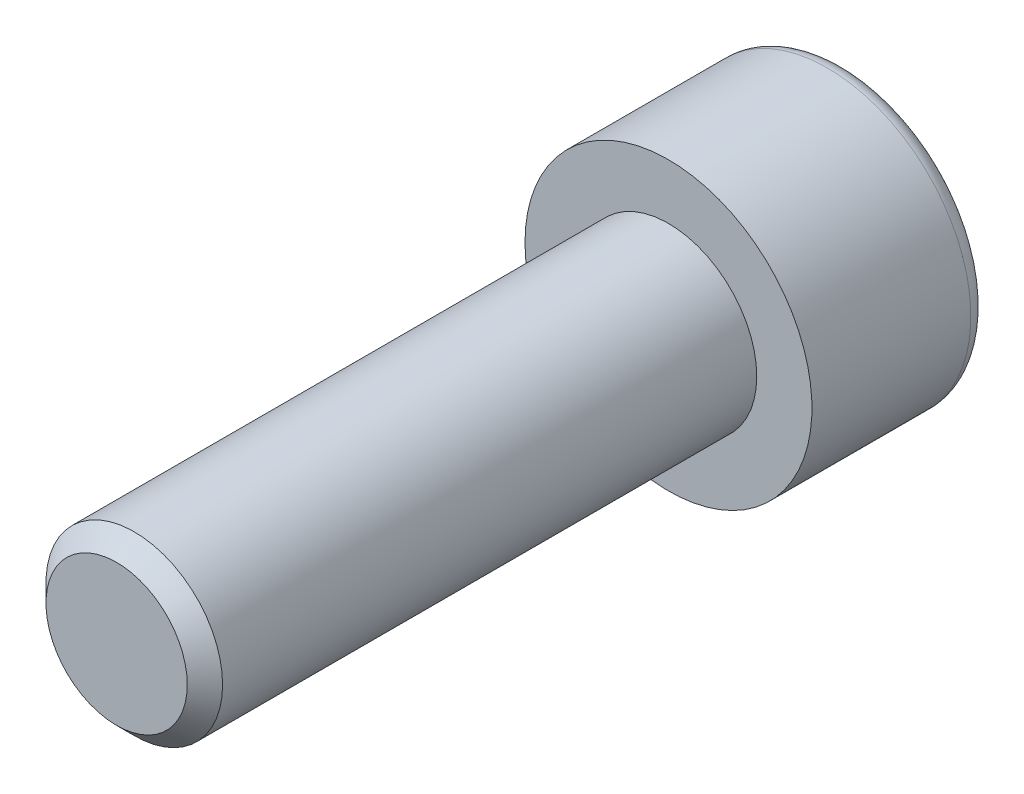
from build123d import *

# Parameters (mm, degrees)
ENLEV_MAT_EXTRU1_DEPTH = 4
ESQUISSE3_W            = 4
ESQUISSE3_H            = 25
CHANFREIN1_SIZE        = 0.8


with BuildPart() as part:
    # Esquisse1 → Base-R_volution (revolve)
    with BuildSketch(Plane(origin=(0, 0, 0), x_dir=(1, 0, 0), z_dir=(0, 1, 0)), mode=Mode.PRIVATE) as base_r_volution_sk:
        with BuildLine():
            Line((0, 0), (6.5, 0))
            Line((6.5, 0), (6.5, 7.2))
            ThreePointArc((6.5, 7.2), (6.265685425, 7.765685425), (5.7, 8))
            Line((5.7, 8), (0, 8))
            Line((0, 8), (0, 0))
        make_face()
    revolve(base_r_volution_sk.sketch.rotate(Axis((0, 0, 0), (0, 0, -1)), 180), axis=Axis((0, 0, 0), (0, 0, -1)))

    # Esquisse2 → enlev-mat-Extru1 (cut)
    with BuildSketch(Plane.XY.offset(-8)):
        Polygon((3, -1.732050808), (3, 1.732050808), (0, 3.464101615), (-3, 1.732050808), (-3, -1.732050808), (0, -3.464101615), align=None)
    extrude(amount=ENLEV_MAT_EXTRU1_DEPTH, mode=Mode.SUBTRACT)

    # Esquisse3 → Boss.-R_vol.1 (revolve)
    with BuildSketch(Plane(origin=(0, 0, 0), x_dir=(1, 0, 0), z_dir=(0, 1, 0))):
        with Locations((2, -12.5)):
            Rectangle(ESQUISSE3_W, ESQUISSE3_H)
    revolve(axis=Axis((0, 0, 0), (0, 0, 1)))

    # Chanfrein1
    chanfrein1_edges = [part.edges().sort_by_distance(p)[0] for p in [
        (-4, 0, 25),
    ]]
    chamfer(chanfrein1_edges, length=CHANFREIN1_SIZE)


solid = part.part
